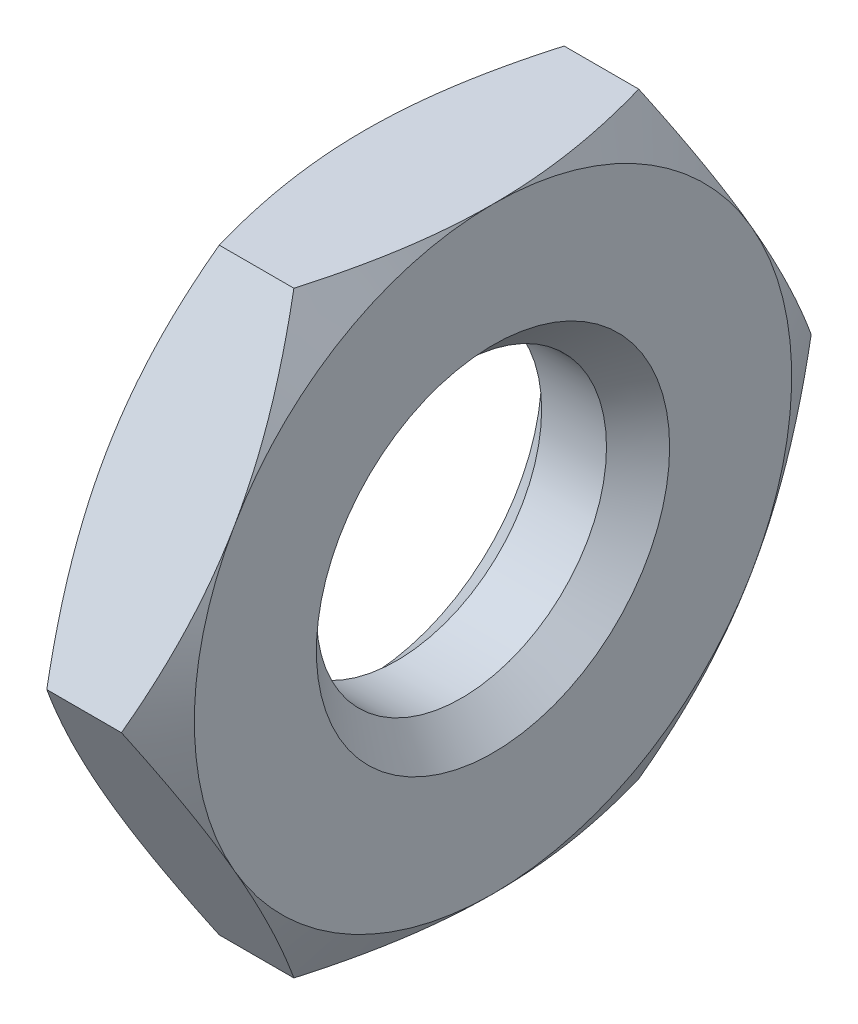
ISO-10303-21;
HEADER;
FILE_DESCRIPTION(('STEP AP214'),'2;1');
FILE_NAME('part.step','',(''),(''),'','','');
FILE_SCHEMA(('AUTOMOTIVE_DESIGN { 1 0 10303 214 1 1 1 1 }'));
ENDSEC;
DATA;
#1=APPLICATION_CONTEXT('core data for automotive mechanical design processes');
#2=APPLICATION_PROTOCOL_DEFINITION('international standard','automotive_design',2000,#1);
#3=PRODUCT_CONTEXT('',#1,'mechanical');
#4=PRODUCT('Part','Part','',(#3));
#5=PRODUCT_RELATED_PRODUCT_CATEGORY('part','',(#4));
#6=PRODUCT_DEFINITION_FORMATION('','',#4);
#7=PRODUCT_DEFINITION_CONTEXT('part definition',#1,'design');
#8=PRODUCT_DEFINITION('design','',#6,#7);
#9=PRODUCT_DEFINITION_SHAPE('','',#8);
#10=(LENGTH_UNIT() NAMED_UNIT(*) SI_UNIT(.MILLI.,.METRE.));
#11=(NAMED_UNIT(*) PLANE_ANGLE_UNIT() SI_UNIT($,.RADIAN.));
#12=(NAMED_UNIT(*) SI_UNIT($,.STERADIAN.) SOLID_ANGLE_UNIT());
#13=UNCERTAINTY_MEASURE_WITH_UNIT(LENGTH_MEASURE(1.E-05),#10,'distance_accuracy_value','');
#14=(GEOMETRIC_REPRESENTATION_CONTEXT(3) GLOBAL_UNCERTAINTY_ASSIGNED_CONTEXT((#13)) GLOBAL_UNIT_ASSIGNED_CONTEXT((#10,
#11,#12)) REPRESENTATION_CONTEXT('',''));
#15=CARTESIAN_POINT('',(0.,0.,0.));
#16=DIRECTION('',(0.,0.,1.));
#17=DIRECTION('',(1.,0.,0.));
#18=AXIS2_PLACEMENT_3D('',#15,#16,#17);
#19=CARTESIAN_POINT('',(0.75,1.75,-1.01036297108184));
#20=DIRECTION('',(1.,0.,0.));
#21=DIRECTION('',(0.,0.,-1.));
#22=AXIS2_PLACEMENT_3D('',#19,#20,#21);
#23=PLANE('',#22);
#24=CARTESIAN_POINT('',(0.75,0.,0.));
#25=DIRECTION('',(1.,0.,0.));
#26=DIRECTION('',(0.,0.,-1.));
#27=AXIS2_PLACEMENT_3D('',#24,#25,#26);
#28=CIRCLE('',#27,1.035);
#29=CARTESIAN_POINT('',(0.75,0.,-1.035));
#30=VERTEX_POINT('',#29);
#31=EDGE_CURVE('E11',#30,#30,#28,.F.);
#32=ORIENTED_EDGE('',*,*,#31,.T.);
#33=EDGE_LOOP('',(#32));
#34=FACE_BOUND('',#33,.T.);
#35=CARTESIAN_POINT('',(0.75,0.,0.));
#36=DIRECTION('',(1.,0.,0.));
#37=DIRECTION('',(0.,0.,-1.));
#38=AXIS2_PLACEMENT_3D('',#35,#36,#37);
#39=CIRCLE('',#38,1.75);
#40=CARTESIAN_POINT('',(0.75,-1.75,0.));
#41=VERTEX_POINT('',#40);
#42=CARTESIAN_POINT('',(0.75,-0.875000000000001,-1.51554445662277));
#43=VERTEX_POINT('',#42);
#44=EDGE_CURVE('E142',#41,#43,#39,.T.);
#45=ORIENTED_EDGE('',*,*,#44,.T.);
#46=CARTESIAN_POINT('',(0.75,0.875000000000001,-1.51554445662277));
#47=VERTEX_POINT('',#46);
#48=EDGE_CURVE('E130',#43,#47,#39,.T.);
#49=ORIENTED_EDGE('',*,*,#48,.T.);
#50=CARTESIAN_POINT('',(0.75,1.75,0.));
#51=VERTEX_POINT('',#50);
#52=EDGE_CURVE('E144',#47,#51,#39,.T.);
#53=ORIENTED_EDGE('',*,*,#52,.T.);
#54=CARTESIAN_POINT('',(0.75,0.875,1.51554445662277));
#55=VERTEX_POINT('',#54);
#56=EDGE_CURVE('E55',#51,#55,#39,.T.);
#57=ORIENTED_EDGE('',*,*,#56,.T.);
#58=CARTESIAN_POINT('',(0.75,-0.875,1.51554445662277));
#59=VERTEX_POINT('',#58);
#60=EDGE_CURVE('E63',#55,#59,#39,.T.);
#61=ORIENTED_EDGE('',*,*,#60,.T.);
#62=EDGE_CURVE('E166',#59,#41,#39,.T.);
#63=ORIENTED_EDGE('',*,*,#62,.T.);
#64=EDGE_LOOP('',(#45,#49,#53,#57,#61,#63));
#65=FACE_BOUND('',#64,.T.);
#66=ADVANCED_FACE('F39',(#34,#65),#23,.T.);
#67=CARTESIAN_POINT('',(0.,1.75,-1.01036297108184));
#68=DIRECTION('',(1.,0.,0.));
#69=DIRECTION('',(0.,0.,-1.));
#70=AXIS2_PLACEMENT_3D('',#67,#68,#69);
#71=PLANE('',#70);
#72=CARTESIAN_POINT('',(0.,0.,0.));
#73=DIRECTION('',(1.,0.,0.));
#74=DIRECTION('',(0.,0.,-1.));
#75=AXIS2_PLACEMENT_3D('',#72,#73,#74);
#76=CIRCLE('',#75,1.035);
#77=CARTESIAN_POINT('',(0.,0.,-1.035));
#78=VERTEX_POINT('',#77);
#79=EDGE_CURVE('E164',#78,#78,#76,.T.);
#80=ORIENTED_EDGE('',*,*,#79,.T.);
#81=EDGE_LOOP('',(#80));
#82=FACE_BOUND('',#81,.T.);
#83=CARTESIAN_POINT('',(0.,0.,0.));
#84=DIRECTION('',(1.,0.,0.));
#85=DIRECTION('',(0.,0.,-1.));
#86=AXIS2_PLACEMENT_3D('',#83,#84,#85);
#87=CIRCLE('',#86,1.75);
#88=CARTESIAN_POINT('',(0.,-0.875,-1.51554445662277));
#89=VERTEX_POINT('',#88);
#90=CARTESIAN_POINT('',(0.,0.875000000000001,-1.51554445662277));
#91=VERTEX_POINT('',#90);
#92=EDGE_CURVE('E173',#89,#91,#87,.T.);
#93=ORIENTED_EDGE('',*,*,#92,.F.);
#94=CARTESIAN_POINT('',(0.,-1.75,0.));
#95=VERTEX_POINT('',#94);
#96=EDGE_CURVE('E318',#95,#89,#87,.T.);
#97=ORIENTED_EDGE('',*,*,#96,.F.);
#98=CARTESIAN_POINT('',(0.,-0.875,1.51554445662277));
#99=VERTEX_POINT('',#98);
#100=EDGE_CURVE('E321',#99,#95,#87,.T.);
#101=ORIENTED_EDGE('',*,*,#100,.F.);
#102=CARTESIAN_POINT('',(0.,0.875,1.51554445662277));
#103=VERTEX_POINT('',#102);
#104=EDGE_CURVE('E327',#103,#99,#87,.T.);
#105=ORIENTED_EDGE('',*,*,#104,.F.);
#106=CARTESIAN_POINT('',(0.,1.75,0.));
#107=VERTEX_POINT('',#106);
#108=EDGE_CURVE('E178',#107,#103,#87,.T.);
#109=ORIENTED_EDGE('',*,*,#108,.F.);
#110=EDGE_CURVE('E174',#91,#107,#87,.T.);
#111=ORIENTED_EDGE('',*,*,#110,.F.);
#112=EDGE_LOOP('',(#93,#97,#101,#105,#109,#111));
#113=FACE_BOUND('',#112,.T.);
#114=ADVANCED_FACE('F319',(#82,#113),#71,.F.);
#115=CARTESIAN_POINT('',(0.75,0.,0.));
#116=DIRECTION('',(-1.,0.,0.));
#117=DIRECTION('',(0.,0.,1.));
#118=AXIS2_PLACEMENT_3D('',#115,#116,#117);
#119=CYLINDRICAL_SURFACE('',#118,0.85);
#120=CARTESIAN_POINT('',(0.185000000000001,0.,0.));
#121=DIRECTION('',(1.,0.,0.));
#122=DIRECTION('',(0.,0.,-1.));
#123=AXIS2_PLACEMENT_3D('',#120,#121,#122);
#124=CIRCLE('',#123,0.85);
#125=CARTESIAN_POINT('',(0.185000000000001,0.,-0.85));
#126=VERTEX_POINT('',#125);
#127=EDGE_CURVE('E48',#126,#126,#124,.F.);
#128=ORIENTED_EDGE('',*,*,#127,.T.);
#129=EDGE_LOOP('',(#128));
#130=FACE_BOUND('',#129,.T.);
#131=CARTESIAN_POINT('',(0.565000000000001,0.,0.));
#132=DIRECTION('',(1.,0.,0.));
#133=DIRECTION('',(0.,0.,-1.));
#134=AXIS2_PLACEMENT_3D('',#131,#132,#133);
#135=CIRCLE('',#134,0.85);
#136=CARTESIAN_POINT('',(0.565000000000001,0.,-0.85));
#137=VERTEX_POINT('',#136);
#138=EDGE_CURVE('E389',#137,#137,#135,.T.);
#139=ORIENTED_EDGE('',*,*,#138,.T.);
#140=EDGE_LOOP('',(#139));
#141=FACE_BOUND('',#140,.T.);
#142=ADVANCED_FACE('F234',(#130,#141),#119,.F.);
#143=CARTESIAN_POINT('',(0.,0.,0.));
#144=DIRECTION('',(1.,0.,0.));
#145=DIRECTION('',(0.,0.,-1.));
#146=AXIS2_PLACEMENT_3D('',#143,#144,#145);
#147=CONICAL_SURFACE('',#146,1.75,1.0471975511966);
#148=CARTESIAN_POINT('',(0.156370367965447,-1.7502,-1.01024750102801));
#149=CARTESIAN_POINT('',(0.130723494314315,-1.67329472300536,-1.05464878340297));
#150=CARTESIAN_POINT('',(0.107398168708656,-1.59572560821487,-1.09943333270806));
#151=CARTESIAN_POINT('',(0.0666825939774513,-1.43924404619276,-1.18977800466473));
#152=CARTESIAN_POINT('',(0.0493067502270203,-1.36032881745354,-1.23533973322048));
#153=CARTESIAN_POINT('',(0.0222573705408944,-1.20347641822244,-1.3258985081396));
#154=CARTESIAN_POINT('',(0.0124038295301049,-1.12556338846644,-1.3708816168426));
#155=CARTESIAN_POINT('',(0.000638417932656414,-0.96937051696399,-1.46105961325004));
#156=CARTESIAN_POINT('',(-0.00128319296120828,-0.891091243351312,-1.50625417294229));
#157=CARTESIAN_POINT('',(0.00270360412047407,-0.74480845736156,-1.59071057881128));
#158=CARTESIAN_POINT('',(0.00763311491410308,-0.676783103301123,-1.6299850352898));
#159=CARTESIAN_POINT('',(0.0232601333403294,-0.541175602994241,-1.70827806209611));
#160=CARTESIAN_POINT('',(0.0339629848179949,-0.4735939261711,-1.74729636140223));
#161=CARTESIAN_POINT('',(0.0607206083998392,-0.337706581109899,-1.82575095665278));
#162=CARTESIAN_POINT('',(0.0768888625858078,-0.269418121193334,-1.86517731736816));
#163=CARTESIAN_POINT('',(0.113584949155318,-0.133860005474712,-1.94344183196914));
#164=CARTESIAN_POINT('',(0.134104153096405,-0.0665886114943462,-1.98228098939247));
#165=CARTESIAN_POINT('',(0.156370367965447,0.000200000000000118,-2.02084141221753));
#166=B_SPLINE_CURVE_WITH_KNOTS('',3,(#148,#149,#150,#151,#152,#153,#154,#155,#156,#157,#158,
#159,#160,#161,#162,#163,#164,#165),.UNSPECIFIED.,.F.,.F.,(4,2,2,2,2,2,2,2,4),(0.,
0.277404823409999,0.55547664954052,0.826665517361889,1.09752126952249,1.33340700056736,
1.56951144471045,1.8108547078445,2.05172376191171),.UNSPECIFIED.);
#167=CARTESIAN_POINT('',(0.156303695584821,0.,-2.02072594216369));
#168=VERTEX_POINT('',#167);
#169=EDGE_CURVE('E334',#89,#168,#166,.T.);
#170=ORIENTED_EDGE('',*,*,#169,.F.);
#171=ORIENTED_EDGE('',*,*,#92,.T.);
#172=CARTESIAN_POINT('',(0.156370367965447,-0.00020000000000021,-2.02084141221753));
#173=CARTESIAN_POINT('',(0.130723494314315,0.0767052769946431,-1.97644012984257));
#174=CARTESIAN_POINT('',(0.107398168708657,0.154274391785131,-1.93165558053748));
#175=CARTESIAN_POINT('',(0.0666825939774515,0.310755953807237,-1.8413109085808));
#176=CARTESIAN_POINT('',(0.0493067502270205,0.389671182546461,-1.79574918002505));
#177=CARTESIAN_POINT('',(0.0222573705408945,0.546523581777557,-1.70519040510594));
#178=CARTESIAN_POINT('',(0.012403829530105,0.624436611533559,-1.66020729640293));
#179=CARTESIAN_POINT('',(0.000638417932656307,0.78062948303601,-1.57002929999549));
#180=CARTESIAN_POINT('',(-0.00128319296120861,0.858908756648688,-1.52483474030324));
#181=CARTESIAN_POINT('',(0.00270360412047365,1.00519154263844,-1.44037833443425));
#182=CARTESIAN_POINT('',(0.00763311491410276,1.07321689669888,-1.40110387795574));
#183=CARTESIAN_POINT('',(0.0232601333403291,1.20882439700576,-1.32281085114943));
#184=CARTESIAN_POINT('',(0.0339629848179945,1.2764060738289,-1.2837925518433));
#185=CARTESIAN_POINT('',(0.0607206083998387,1.4122934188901,-1.20533795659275));
#186=CARTESIAN_POINT('',(0.0768888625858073,1.48058187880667,-1.16591159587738));
#187=CARTESIAN_POINT('',(0.113584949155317,1.61613999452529,-1.08764708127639));
#188=CARTESIAN_POINT('',(0.134104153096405,1.68341138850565,-1.04880792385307));
#189=CARTESIAN_POINT('',(0.156370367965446,1.7502,-1.01024750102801));
#190=B_SPLINE_CURVE_WITH_KNOTS('',3,(#172,#173,#174,#175,#176,#177,#178,#179,#180,#181,#182,
#183,#184,#185,#186,#187,#188,#189),.UNSPECIFIED.,.F.,.F.,(4,2,2,2,2,2,2,2,4),(0.,
0.277404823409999,0.55547664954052,0.826665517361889,1.09752126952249,1.33340700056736,
1.56951144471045,1.8108547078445,2.05172376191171),.UNSPECIFIED.);
#191=EDGE_CURVE('E215',#168,#91,#190,.T.);
#192=ORIENTED_EDGE('',*,*,#191,.F.);
#193=EDGE_LOOP('',(#170,#171,#192));
#194=FACE_BOUND('',#193,.T.);
#195=ADVANCED_FACE('F194',(#194),#147,.T.);
#196=ORIENTED_EDGE('',*,*,#96,.T.);
#197=CARTESIAN_POINT('',(0.156303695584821,-1.75,-1.01036297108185));
#198=VERTEX_POINT('',#197);
#199=EDGE_CURVE('E156',#198,#89,#166,.T.);
#200=ORIENTED_EDGE('',*,*,#199,.F.);
#201=CARTESIAN_POINT('',(0.852167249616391,-1.75,-2.71008421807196));
#202=CARTESIAN_POINT('',(0.815121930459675,-1.75,-2.63368408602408));
#203=CARTESIAN_POINT('',(0.778432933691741,-1.75,-2.55710815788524));
#204=CARTESIAN_POINT('',(0.705968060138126,-1.75,-2.40351121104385));
#205=CARTESIAN_POINT('',(0.670192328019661,-1.75,-2.3264901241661));
#206=CARTESIAN_POINT('',(0.599573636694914,-1.75,-2.17151065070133));
#207=CARTESIAN_POINT('',(0.564736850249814,-1.75,-2.09354944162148));
#208=CARTESIAN_POINT('',(0.496494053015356,-1.75,-1.93700560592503));
#209=CARTESIAN_POINT('',(0.463087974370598,-1.75,-1.85842300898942));
#210=CARTESIAN_POINT('',(0.397041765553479,-1.75,-1.6979784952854));
#211=CARTESIAN_POINT('',(0.364460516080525,-1.75,-1.61609220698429));
#212=CARTESIAN_POINT('',(0.301780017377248,-1.75,-1.45137686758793));
#213=CARTESIAN_POINT('',(0.271680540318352,-1.75,-1.36854790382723));
#214=CARTESIAN_POINT('',(0.214746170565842,-1.75,-1.20194685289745));
#215=CARTESIAN_POINT('',(0.187904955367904,-1.75,-1.11817694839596));
#216=CARTESIAN_POINT('',(0.138354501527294,-1.75,-0.949435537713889));
#217=CARTESIAN_POINT('',(0.115643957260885,-1.75,-0.864464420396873));
#218=CARTESIAN_POINT('',(0.075568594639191,-1.75,-0.69374480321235));
#219=CARTESIAN_POINT('',(0.0581748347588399,-1.75,-0.608003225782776));
#220=CARTESIAN_POINT('',(0.0297174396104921,-1.75,-0.435458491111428));
#221=CARTESIAN_POINT('',(0.0186532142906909,-1.75,-0.348655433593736));
#222=CARTESIAN_POINT('',(0.00388537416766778,-1.75,-0.175550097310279));
#223=CARTESIAN_POINT('',(8.74575374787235E-05,-1.75,-0.0892560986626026));
#224=CARTESIAN_POINT('',(-8.45672730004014E-05,-1.75,0.0833363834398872));
#225=CARTESIAN_POINT('',(0.00354146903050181,-1.75,0.169634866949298));
#226=CARTESIAN_POINT('',(0.0208500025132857,-1.75,0.376909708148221));
#227=CARTESIAN_POINT('',(0.0380466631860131,-1.75,0.49759441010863));
#228=CARTESIAN_POINT('',(0.0839386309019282,-1.75,0.736761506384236));
#229=CARTESIAN_POINT('',(0.112645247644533,-1.75,0.855241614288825));
#230=CARTESIAN_POINT('',(0.179145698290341,-1.75,1.09237455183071));
#231=CARTESIAN_POINT('',(0.217125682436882,-1.75,1.21097375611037));
#232=CARTESIAN_POINT('',(0.299164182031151,-1.75,1.44596952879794));
#233=CARTESIAN_POINT('',(0.343221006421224,-1.75,1.56236669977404));
#234=CARTESIAN_POINT('',(0.450980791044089,-1.75,1.83207817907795));
#235=CARTESIAN_POINT('',(0.516328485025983,-1.75,1.98472852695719));
#236=CARTESIAN_POINT('',(0.651758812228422,-1.75,2.28792751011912));
#237=CARTESIAN_POINT('',(0.721842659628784,-1.75,2.43847559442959));
#238=CARTESIAN_POINT('',(0.865206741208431,-1.75,2.73821531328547));
#239=CARTESIAN_POINT('',(0.938490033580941,-1.75,2.88740547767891));
#240=CARTESIAN_POINT('',(1.08720647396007,-1.75,3.18471144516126));
#241=CARTESIAN_POINT('',(1.16263969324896,-1.75,3.3328272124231));
#242=CARTESIAN_POINT('',(1.30880326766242,-1.75,3.61618537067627));
#243=CARTESIAN_POINT('',(1.37941363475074,-1.75,3.75148981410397));
#244=CARTESIAN_POINT('',(1.52160774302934,-1.75,4.02159130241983));
#245=CARTESIAN_POINT('',(1.59319151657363,-1.75,4.15638833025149));
#246=CARTESIAN_POINT('',(1.73693002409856,-1.75,4.4252610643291));
#247=CARTESIAN_POINT('',(1.80908297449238,-1.75,4.55933772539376));
#248=CARTESIAN_POINT('',(1.9539741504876,-1.75,4.82716533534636));
#249=CARTESIAN_POINT('',(2.02671234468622,-1.75,4.96091630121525));
#250=CARTESIAN_POINT('',(2.09966957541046,-1.75,5.09454682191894));
#251=B_SPLINE_CURVE_WITH_KNOTS('',3,(#201,#202,#203,#204,#205,#206,#207,#208,#209,#210,#211,
#212,#213,#214,#215,#216,#217,#218,#219,#220,#221,#222,#223,#224,#225,#226,#227,#228,#229,#230,
#231,#232,#233,#234,#235,#236,#237,#238,#239,#240,#241,#242,#243,#244,#245,#246,#247,#248,#249,
#250),.UNSPECIFIED.,.F.,.F.,(4,2,2,2,2,2,2,2,2,2,2,2,2,2,2,2,2,2,2,2,2,2,2,2,4),(0.,
0.254726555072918,0.509493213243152,0.765653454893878,1.02180153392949,1.28616067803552,
1.55049552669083,1.81430895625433,2.07803885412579,2.34030648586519,2.60254966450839,
2.86136574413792,3.12018686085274,3.48514477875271,3.85046218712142,4.22382243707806,
4.59707899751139,5.09508985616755,5.59322887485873,6.0918549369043,6.59049755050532,
7.04835507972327,7.50622786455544,7.96300127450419,8.41975033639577),.UNSPECIFIED.);
#252=EDGE_CURVE('E177',#95,#198,#251,.F.);
#253=ORIENTED_EDGE('',*,*,#252,.F.);
#254=EDGE_LOOP('',(#196,#200,#253));
#255=FACE_BOUND('',#254,.T.);
#256=ADVANCED_FACE('F353',(#255),#147,.T.);
#257=CARTESIAN_POINT('',(0.375,0.,0.));
#258=DIRECTION('',(-1.,0.,0.));
#259=DIRECTION('',(0.,0.,1.));
#260=AXIS2_PLACEMENT_3D('',#257,#258,#259);
#261=CONICAL_SURFACE('',#260,2.39951905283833,1.0471975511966);
#262=CARTESIAN_POINT('',(0.593629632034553,0.000199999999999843,-2.02084141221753));
#263=CARTESIAN_POINT('',(0.619276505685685,-0.0767052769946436,-1.97644012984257));
#264=CARTESIAN_POINT('',(0.642601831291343,-0.154274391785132,-1.93165558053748));
#265=CARTESIAN_POINT('',(0.683317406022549,-0.310755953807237,-1.8413109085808));
#266=CARTESIAN_POINT('',(0.70069324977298,-0.389671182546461,-1.79574918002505));
#267=CARTESIAN_POINT('',(0.727742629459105,-0.546523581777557,-1.70519040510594));
#268=CARTESIAN_POINT('',(0.737596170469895,-0.624436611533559,-1.66020729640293));
#269=CARTESIAN_POINT('',(0.749361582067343,-0.780629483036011,-1.57002929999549));
#270=CARTESIAN_POINT('',(0.751283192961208,-0.858908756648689,-1.52483474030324));
#271=CARTESIAN_POINT('',(0.747296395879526,-1.00519154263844,-1.44037833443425));
#272=CARTESIAN_POINT('',(0.742366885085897,-1.07321689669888,-1.40110387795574));
#273=CARTESIAN_POINT('',(0.72673986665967,-1.20882439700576,-1.32281085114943));
#274=CARTESIAN_POINT('',(0.716037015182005,-1.2764060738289,-1.2837925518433));
#275=CARTESIAN_POINT('',(0.689279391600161,-1.4122934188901,-1.20533795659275));
#276=CARTESIAN_POINT('',(0.673111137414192,-1.48058187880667,-1.16591159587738));
#277=CARTESIAN_POINT('',(0.636415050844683,-1.61613999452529,-1.08764708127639));
#278=CARTESIAN_POINT('',(0.615895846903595,-1.68341138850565,-1.04880792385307));
#279=CARTESIAN_POINT('',(0.593629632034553,-1.7502,-1.01024750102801));
#280=B_SPLINE_CURVE_WITH_KNOTS('',3,(#262,#263,#264,#265,#266,#267,#268,#269,#270,#271,#272,
#273,#274,#275,#276,#277,#278,#279),.UNSPECIFIED.,.F.,.F.,(4,2,2,2,2,2,2,2,4),(0.,
0.277404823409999,0.55547664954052,0.82666551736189,1.09752126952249,1.33340700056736,
1.56951144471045,1.8108547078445,2.05172376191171),.UNSPECIFIED.);
#281=CARTESIAN_POINT('',(0.593696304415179,-1.75,-1.01036297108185));
#282=VERTEX_POINT('',#281);
#283=EDGE_CURVE('E147',#43,#282,#280,.T.);
#284=ORIENTED_EDGE('',*,*,#283,.F.);
#285=ORIENTED_EDGE('',*,*,#44,.F.);
#286=CARTESIAN_POINT('',(-0.102167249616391,-1.75,-2.71008421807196));
#287=CARTESIAN_POINT('',(-0.0651219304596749,-1.75,-2.63368408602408));
#288=CARTESIAN_POINT('',(-0.0284329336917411,-1.75,-2.55710815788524));
#289=CARTESIAN_POINT('',(0.0440319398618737,-1.75,-2.40351121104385));
#290=CARTESIAN_POINT('',(0.0798076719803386,-1.75,-2.3264901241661));
#291=CARTESIAN_POINT('',(0.150426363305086,-1.75,-2.17151065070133));
#292=CARTESIAN_POINT('',(0.185263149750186,-1.75,-2.09354944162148));
#293=CARTESIAN_POINT('',(0.253505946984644,-1.75,-1.93700560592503));
#294=CARTESIAN_POINT('',(0.286912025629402,-1.75,-1.85842300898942));
#295=CARTESIAN_POINT('',(0.352958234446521,-1.75,-1.6979784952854));
#296=CARTESIAN_POINT('',(0.385539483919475,-1.75,-1.61609220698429));
#297=CARTESIAN_POINT('',(0.448219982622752,-1.75,-1.45137686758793));
#298=CARTESIAN_POINT('',(0.478319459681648,-1.75,-1.36854790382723));
#299=CARTESIAN_POINT('',(0.535253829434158,-1.75,-1.20194685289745));
#300=CARTESIAN_POINT('',(0.562095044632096,-1.75,-1.11817694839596));
#301=CARTESIAN_POINT('',(0.611645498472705,-1.75,-0.949435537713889));
#302=CARTESIAN_POINT('',(0.634356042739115,-1.75,-0.864464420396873));
#303=CARTESIAN_POINT('',(0.674431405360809,-1.75,-0.69374480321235));
#304=CARTESIAN_POINT('',(0.69182516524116,-1.75,-0.608003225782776));
#305=CARTESIAN_POINT('',(0.720282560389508,-1.75,-0.435458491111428));
#306=CARTESIAN_POINT('',(0.731346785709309,-1.75,-0.348655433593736));
#307=CARTESIAN_POINT('',(0.746114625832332,-1.75,-0.175550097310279));
#308=CARTESIAN_POINT('',(0.749912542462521,-1.75,-0.0892560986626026));
#309=CARTESIAN_POINT('',(0.750084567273,-1.75,0.0833363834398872));
#310=CARTESIAN_POINT('',(0.746458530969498,-1.75,0.169634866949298));
#311=CARTESIAN_POINT('',(0.729149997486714,-1.75,0.376909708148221));
#312=CARTESIAN_POINT('',(0.711953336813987,-1.75,0.49759441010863));
#313=CARTESIAN_POINT('',(0.666061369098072,-1.75,0.736761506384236));
#314=CARTESIAN_POINT('',(0.637354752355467,-1.75,0.855241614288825));
#315=CARTESIAN_POINT('',(0.570854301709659,-1.75,1.09237455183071));
#316=CARTESIAN_POINT('',(0.532874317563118,-1.75,1.21097375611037));
#317=CARTESIAN_POINT('',(0.450835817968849,-1.75,1.44596952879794));
#318=CARTESIAN_POINT('',(0.406778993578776,-1.75,1.56236669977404));
#319=CARTESIAN_POINT('',(0.299019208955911,-1.75,1.83207817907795));
#320=CARTESIAN_POINT('',(0.233671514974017,-1.75,1.98472852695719));
#321=CARTESIAN_POINT('',(0.0982411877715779,-1.75,2.28792751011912));
#322=CARTESIAN_POINT('',(0.0281573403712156,-1.75,2.43847559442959));
#323=CARTESIAN_POINT('',(-0.115206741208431,-1.75,2.73821531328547));
#324=CARTESIAN_POINT('',(-0.188490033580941,-1.75,2.88740547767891));
#325=CARTESIAN_POINT('',(-0.337206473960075,-1.75,3.18471144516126));
#326=CARTESIAN_POINT('',(-0.412639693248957,-1.75,3.3328272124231));
#327=CARTESIAN_POINT('',(-0.558803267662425,-1.75,3.61618537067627));
#328=CARTESIAN_POINT('',(-0.629413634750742,-1.75,3.75148981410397));
#329=CARTESIAN_POINT('',(-0.77160774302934,-1.75,4.02159130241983));
#330=CARTESIAN_POINT('',(-0.843191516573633,-1.75,4.15638833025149));
#331=CARTESIAN_POINT('',(-0.986930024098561,-1.75,4.4252610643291));
#332=CARTESIAN_POINT('',(-1.05908297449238,-1.75,4.55933772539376));
#333=CARTESIAN_POINT('',(-1.2039741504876,-1.75,4.82716533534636));
#334=CARTESIAN_POINT('',(-1.27671234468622,-1.75,4.96091630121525));
#335=CARTESIAN_POINT('',(-1.34966957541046,-1.75,5.09454682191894));
#336=B_SPLINE_CURVE_WITH_KNOTS('',3,(#286,#287,#288,#289,#290,#291,#292,#293,#294,#295,#296,
#297,#298,#299,#300,#301,#302,#303,#304,#305,#306,#307,#308,#309,#310,#311,#312,#313,#314,#315,
#316,#317,#318,#319,#320,#321,#322,#323,#324,#325,#326,#327,#328,#329,#330,#331,#332,#333,#334,
#335),.UNSPECIFIED.,.F.,.F.,(4,2,2,2,2,2,2,2,2,2,2,2,2,2,2,2,2,2,2,2,2,2,2,2,4),(0.,
0.254726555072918,0.509493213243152,0.765653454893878,1.02180153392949,1.28616067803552,
1.55049552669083,1.81430895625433,2.07803885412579,2.34030648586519,2.60254966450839,
2.86136574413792,3.12018686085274,3.48514477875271,3.85046218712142,4.22382243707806,
4.59707899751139,5.09508985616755,5.59322887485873,6.0918549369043,6.59049755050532,
7.04835507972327,7.50622786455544,7.96300127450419,8.41975033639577),.UNSPECIFIED.);
#337=EDGE_CURVE('E151',#282,#41,#336,.T.);
#338=ORIENTED_EDGE('',*,*,#337,.F.);
#339=EDGE_LOOP('',(#284,#285,#338));
#340=FACE_BOUND('',#339,.T.);
#341=ADVANCED_FACE('F148',(#340),#261,.T.);
#342=ORIENTED_EDGE('',*,*,#48,.F.);
#343=CARTESIAN_POINT('',(0.593696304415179,0.,-2.02072594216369));
#344=VERTEX_POINT('',#343);
#345=EDGE_CURVE('E134',#344,#43,#280,.T.);
#346=ORIENTED_EDGE('',*,*,#345,.F.);
#347=CARTESIAN_POINT('',(0.593629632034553,1.7502,-1.01024750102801));
#348=CARTESIAN_POINT('',(0.619276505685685,1.67329472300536,-1.05464878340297));
#349=CARTESIAN_POINT('',(0.642601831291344,1.59572560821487,-1.09943333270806));
#350=CARTESIAN_POINT('',(0.683317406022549,1.43924404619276,-1.18977800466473));
#351=CARTESIAN_POINT('',(0.70069324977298,1.36032881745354,-1.23533973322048));
#352=CARTESIAN_POINT('',(0.727742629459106,1.20347641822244,-1.3258985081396));
#353=CARTESIAN_POINT('',(0.737596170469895,1.12556338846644,-1.3708816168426));
#354=CARTESIAN_POINT('',(0.749361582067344,0.96937051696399,-1.46105961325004));
#355=CARTESIAN_POINT('',(0.751283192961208,0.891091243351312,-1.50625417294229));
#356=CARTESIAN_POINT('',(0.747296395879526,0.74480845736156,-1.59071057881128));
#357=CARTESIAN_POINT('',(0.742366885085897,0.676783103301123,-1.6299850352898));
#358=CARTESIAN_POINT('',(0.72673986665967,0.541175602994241,-1.70827806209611));
#359=CARTESIAN_POINT('',(0.716037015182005,0.4735939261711,-1.74729636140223));
#360=CARTESIAN_POINT('',(0.689279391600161,0.337706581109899,-1.82575095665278));
#361=CARTESIAN_POINT('',(0.673111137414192,0.269418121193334,-1.86517731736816));
#362=CARTESIAN_POINT('',(0.636415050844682,0.133860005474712,-1.94344183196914));
#363=CARTESIAN_POINT('',(0.615895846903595,0.0665886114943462,-1.98228098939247));
#364=CARTESIAN_POINT('',(0.593629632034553,-0.000200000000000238,-2.02084141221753));
#365=B_SPLINE_CURVE_WITH_KNOTS('',3,(#347,#348,#349,#350,#351,#352,#353,#354,#355,#356,#357,
#358,#359,#360,#361,#362,#363,#364),.UNSPECIFIED.,.F.,.F.,(4,2,2,2,2,2,2,2,4),(0.,
0.277404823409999,0.55547664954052,0.826665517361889,1.09752126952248,1.33340700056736,
1.56951144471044,1.8108547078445,2.05172376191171),.UNSPECIFIED.);
#366=EDGE_CURVE('E136',#47,#344,#365,.T.);
#367=ORIENTED_EDGE('',*,*,#366,.F.);
#368=EDGE_LOOP('',(#342,#346,#367));
#369=FACE_BOUND('',#368,.T.);
#370=ADVANCED_FACE('F132',(#369),#261,.T.);
#371=ORIENTED_EDGE('',*,*,#100,.T.);
#372=CARTESIAN_POINT('',(0.156303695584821,-1.75,1.01036297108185));
#373=VERTEX_POINT('',#372);
#374=EDGE_CURVE('E187',#373,#95,#251,.F.);
#375=ORIENTED_EDGE('',*,*,#374,.F.);
#376=CARTESIAN_POINT('',(0.156370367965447,0.000200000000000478,2.02084141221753));
#377=CARTESIAN_POINT('',(0.130723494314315,-0.0767052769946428,1.97644012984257));
#378=CARTESIAN_POINT('',(0.107398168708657,-0.154274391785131,1.93165558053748));
#379=CARTESIAN_POINT('',(0.0666825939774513,-0.310755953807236,1.8413109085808));
#380=CARTESIAN_POINT('',(0.0493067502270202,-0.389671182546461,1.79574918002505));
#381=CARTESIAN_POINT('',(0.0222573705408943,-0.546523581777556,1.70519040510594));
#382=CARTESIAN_POINT('',(0.0124038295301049,-0.624436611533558,1.66020729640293));
#383=CARTESIAN_POINT('',(0.000638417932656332,-0.78062948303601,1.57002929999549));
#384=CARTESIAN_POINT('',(-0.00128319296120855,-0.858908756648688,1.52483474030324));
#385=CARTESIAN_POINT('',(0.00270360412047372,-1.00519154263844,1.44037833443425));
#386=CARTESIAN_POINT('',(0.00763311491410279,-1.07321689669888,1.40110387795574));
#387=CARTESIAN_POINT('',(0.0232601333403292,-1.20882439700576,1.32281085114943));
#388=CARTESIAN_POINT('',(0.0339629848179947,-1.2764060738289,1.2837925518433));
#389=CARTESIAN_POINT('',(0.060720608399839,-1.4122934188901,1.20533795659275));
#390=CARTESIAN_POINT('',(0.0768888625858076,-1.48058187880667,1.16591159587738));
#391=CARTESIAN_POINT('',(0.113584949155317,-1.61613999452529,1.08764708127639));
#392=CARTESIAN_POINT('',(0.134104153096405,-1.68341138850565,1.04880792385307));
#393=CARTESIAN_POINT('',(0.156370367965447,-1.7502,1.01024750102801));
#394=B_SPLINE_CURVE_WITH_KNOTS('',3,(#376,#377,#378,#379,#380,#381,#382,#383,#384,#385,#386,
#387,#388,#389,#390,#391,#392,#393),.UNSPECIFIED.,.F.,.F.,(4,2,2,2,2,2,2,2,4),(0.,
0.277404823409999,0.55547664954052,0.826665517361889,1.09752126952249,1.33340700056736,
1.56951144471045,1.8108547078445,2.05172376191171),.UNSPECIFIED.);
#395=EDGE_CURVE('E188',#99,#373,#394,.T.);
#396=ORIENTED_EDGE('',*,*,#395,.F.);
#397=EDGE_LOOP('',(#371,#375,#396));
#398=FACE_BOUND('',#397,.T.);
#399=ADVANCED_FACE('F352',(#398),#147,.T.);
#400=CARTESIAN_POINT('',(0.593696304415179,-1.75,1.01036297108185));
#401=VERTEX_POINT('',#400);
#402=EDGE_CURVE('E216',#41,#401,#336,.T.);
#403=ORIENTED_EDGE('',*,*,#402,.F.);
#404=ORIENTED_EDGE('',*,*,#62,.F.);
#405=CARTESIAN_POINT('',(0.593629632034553,-1.7502,1.01024750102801));
#406=CARTESIAN_POINT('',(0.619276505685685,-1.67329472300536,1.05464878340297));
#407=CARTESIAN_POINT('',(0.642601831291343,-1.59572560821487,1.09943333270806));
#408=CARTESIAN_POINT('',(0.683317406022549,-1.43924404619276,1.18977800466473));
#409=CARTESIAN_POINT('',(0.70069324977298,-1.36032881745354,1.23533973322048));
#410=CARTESIAN_POINT('',(0.727742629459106,-1.20347641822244,1.3258985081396));
#411=CARTESIAN_POINT('',(0.737596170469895,-1.12556338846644,1.3708816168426));
#412=CARTESIAN_POINT('',(0.749361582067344,-0.96937051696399,1.46105961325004));
#413=CARTESIAN_POINT('',(0.751283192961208,-0.891091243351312,1.50625417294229));
#414=CARTESIAN_POINT('',(0.747296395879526,-0.74480845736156,1.59071057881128));
#415=CARTESIAN_POINT('',(0.742366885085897,-0.676783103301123,1.6299850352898));
#416=CARTESIAN_POINT('',(0.726739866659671,-0.541175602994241,1.70827806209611));
#417=CARTESIAN_POINT('',(0.716037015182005,-0.4735939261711,1.74729636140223));
#418=CARTESIAN_POINT('',(0.689279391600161,-0.337706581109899,1.82575095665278));
#419=CARTESIAN_POINT('',(0.673111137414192,-0.269418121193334,1.86517731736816));
#420=CARTESIAN_POINT('',(0.636415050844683,-0.133860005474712,1.94344183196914));
#421=CARTESIAN_POINT('',(0.615895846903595,-0.0665886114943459,1.98228098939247));
#422=CARTESIAN_POINT('',(0.593629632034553,0.000200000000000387,2.02084141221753));
#423=B_SPLINE_CURVE_WITH_KNOTS('',3,(#405,#406,#407,#408,#409,#410,#411,#412,#413,#414,#415,
#416,#417,#418,#419,#420,#421,#422),.UNSPECIFIED.,.F.,.F.,(4,2,2,2,2,2,2,2,4),(0.,
0.277404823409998,0.55547664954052,0.826665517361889,1.09752126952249,1.33340700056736,
1.56951144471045,1.8108547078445,2.05172376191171),.UNSPECIFIED.);
#424=EDGE_CURVE('E247',#401,#59,#423,.T.);
#425=ORIENTED_EDGE('',*,*,#424,.F.);
#426=EDGE_LOOP('',(#403,#404,#425));
#427=FACE_BOUND('',#426,.T.);
#428=ADVANCED_FACE('F430',(#427),#261,.T.);
#429=ORIENTED_EDGE('',*,*,#104,.T.);
#430=CARTESIAN_POINT('',(0.156303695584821,0.,2.02072594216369));
#431=VERTEX_POINT('',#430);
#432=EDGE_CURVE('E288',#431,#99,#394,.T.);
#433=ORIENTED_EDGE('',*,*,#432,.F.);
#434=CARTESIAN_POINT('',(0.156370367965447,1.7502,1.01024750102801));
#435=CARTESIAN_POINT('',(0.130723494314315,1.67329472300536,1.05464878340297));
#436=CARTESIAN_POINT('',(0.107398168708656,1.59572560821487,1.09943333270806));
#437=CARTESIAN_POINT('',(0.0666825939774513,1.43924404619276,1.18977800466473));
#438=CARTESIAN_POINT('',(0.0493067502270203,1.36032881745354,1.23533973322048));
#439=CARTESIAN_POINT('',(0.0222573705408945,1.20347641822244,1.3258985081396));
#440=CARTESIAN_POINT('',(0.0124038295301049,1.12556338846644,1.3708816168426));
#441=CARTESIAN_POINT('',(0.000638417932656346,0.969370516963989,1.46105961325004));
#442=CARTESIAN_POINT('',(-0.00128319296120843,0.891091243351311,1.50625417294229));
#443=CARTESIAN_POINT('',(0.00270360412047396,0.744808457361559,1.59071057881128));
#444=CARTESIAN_POINT('',(0.00763311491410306,0.676783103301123,1.6299850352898));
#445=CARTESIAN_POINT('',(0.0232601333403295,0.541175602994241,1.70827806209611));
#446=CARTESIAN_POINT('',(0.0339629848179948,0.4735939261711,1.74729636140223));
#447=CARTESIAN_POINT('',(0.0607206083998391,0.3377065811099,1.82575095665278));
#448=CARTESIAN_POINT('',(0.0768888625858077,0.269418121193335,1.86517731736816));
#449=CARTESIAN_POINT('',(0.113584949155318,0.133860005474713,1.94344183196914));
#450=CARTESIAN_POINT('',(0.134104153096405,0.0665886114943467,1.98228098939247));
#451=CARTESIAN_POINT('',(0.156370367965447,-0.000199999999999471,2.02084141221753));
#452=B_SPLINE_CURVE_WITH_KNOTS('',3,(#434,#435,#436,#437,#438,#439,#440,#441,#442,#443,#444,
#445,#446,#447,#448,#449,#450,#451),.UNSPECIFIED.,.F.,.F.,(4,2,2,2,2,2,2,2,4),(0.,
0.277404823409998,0.55547664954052,0.82666551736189,1.09752126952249,1.33340700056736,
1.56951144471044,1.8108547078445,2.05172376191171),.UNSPECIFIED.);
#453=EDGE_CURVE('E282',#103,#431,#452,.T.);
#454=ORIENTED_EDGE('',*,*,#453,.F.);
#455=EDGE_LOOP('',(#429,#433,#454));
#456=FACE_BOUND('',#455,.T.);
#457=ADVANCED_FACE('F232',(#456),#147,.T.);
#458=CARTESIAN_POINT('',(0.593696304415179,0.,2.02072594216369));
#459=VERTEX_POINT('',#458);
#460=EDGE_CURVE('E377',#59,#459,#423,.T.);
#461=ORIENTED_EDGE('',*,*,#460,.F.);
#462=ORIENTED_EDGE('',*,*,#60,.F.);
#463=CARTESIAN_POINT('',(0.593629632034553,-0.000199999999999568,2.02084141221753));
#464=CARTESIAN_POINT('',(0.619276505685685,0.0767052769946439,1.97644012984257));
#465=CARTESIAN_POINT('',(0.642601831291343,0.154274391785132,1.93165558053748));
#466=CARTESIAN_POINT('',(0.683317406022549,0.310755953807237,1.8413109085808));
#467=CARTESIAN_POINT('',(0.70069324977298,0.389671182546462,1.79574918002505));
#468=CARTESIAN_POINT('',(0.727742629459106,0.546523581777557,1.70519040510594));
#469=CARTESIAN_POINT('',(0.737596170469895,0.624436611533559,1.66020729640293));
#470=CARTESIAN_POINT('',(0.749361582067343,0.780629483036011,1.57002929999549));
#471=CARTESIAN_POINT('',(0.751283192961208,0.858908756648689,1.52483474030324));
#472=CARTESIAN_POINT('',(0.747296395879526,1.00519154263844,1.44037833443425));
#473=CARTESIAN_POINT('',(0.742366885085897,1.07321689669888,1.40110387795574));
#474=CARTESIAN_POINT('',(0.72673986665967,1.20882439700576,1.32281085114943));
#475=CARTESIAN_POINT('',(0.716037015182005,1.2764060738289,1.2837925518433));
#476=CARTESIAN_POINT('',(0.689279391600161,1.4122934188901,1.20533795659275));
#477=CARTESIAN_POINT('',(0.673111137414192,1.48058187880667,1.16591159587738));
#478=CARTESIAN_POINT('',(0.636415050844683,1.61613999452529,1.0876470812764));
#479=CARTESIAN_POINT('',(0.615895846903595,1.68341138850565,1.04880792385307));
#480=CARTESIAN_POINT('',(0.593629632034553,1.7502,1.01024750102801));
#481=B_SPLINE_CURVE_WITH_KNOTS('',3,(#463,#464,#465,#466,#467,#468,#469,#470,#471,#472,#473,
#474,#475,#476,#477,#478,#479,#480),.UNSPECIFIED.,.F.,.F.,(4,2,2,2,2,2,2,2,4),(0.,
0.277404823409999,0.55547664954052,0.826665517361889,1.09752126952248,1.33340700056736,
1.56951144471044,1.8108547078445,2.05172376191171),.UNSPECIFIED.);
#482=EDGE_CURVE('E371',#459,#55,#481,.T.);
#483=ORIENTED_EDGE('',*,*,#482,.F.);
#484=EDGE_LOOP('',(#461,#462,#483));
#485=FACE_BOUND('',#484,.T.);
#486=ADVANCED_FACE('F227',(#485),#261,.T.);
#487=ORIENTED_EDGE('',*,*,#108,.T.);
#488=CARTESIAN_POINT('',(0.156303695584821,1.75,1.01036297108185));
#489=VERTEX_POINT('',#488);
#490=EDGE_CURVE('E281',#489,#103,#452,.T.);
#491=ORIENTED_EDGE('',*,*,#490,.F.);
#492=CARTESIAN_POINT('',(0.852167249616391,1.75,-2.71008421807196));
#493=CARTESIAN_POINT('',(0.815121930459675,1.75,-2.63368408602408));
#494=CARTESIAN_POINT('',(0.778432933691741,1.75,-2.55710815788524));
#495=CARTESIAN_POINT('',(0.705968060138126,1.75,-2.40351121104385));
#496=CARTESIAN_POINT('',(0.670192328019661,1.75,-2.3264901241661));
#497=CARTESIAN_POINT('',(0.599573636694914,1.75,-2.17151065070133));
#498=CARTESIAN_POINT('',(0.564736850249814,1.75,-2.09354944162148));
#499=CARTESIAN_POINT('',(0.496494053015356,1.75,-1.93700560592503));
#500=CARTESIAN_POINT('',(0.463087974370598,1.75,-1.85842300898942));
#501=CARTESIAN_POINT('',(0.397041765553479,1.75,-1.6979784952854));
#502=CARTESIAN_POINT('',(0.364460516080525,1.75,-1.61609220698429));
#503=CARTESIAN_POINT('',(0.301780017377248,1.75,-1.45137686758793));
#504=CARTESIAN_POINT('',(0.271680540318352,1.75,-1.36854790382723));
#505=CARTESIAN_POINT('',(0.214746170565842,1.75,-1.20194685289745));
#506=CARTESIAN_POINT('',(0.187904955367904,1.75,-1.11817694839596));
#507=CARTESIAN_POINT('',(0.138354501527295,1.75,-0.94943553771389));
#508=CARTESIAN_POINT('',(0.115643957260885,1.75,-0.864464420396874));
#509=CARTESIAN_POINT('',(0.0755685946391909,1.75,-0.69374480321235));
#510=CARTESIAN_POINT('',(0.0581748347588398,1.75,-0.608003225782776));
#511=CARTESIAN_POINT('',(0.0297174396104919,1.75,-0.435458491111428));
#512=CARTESIAN_POINT('',(0.0186532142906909,1.75,-0.348655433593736));
#513=CARTESIAN_POINT('',(0.00388537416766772,1.75,-0.175550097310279));
#514=CARTESIAN_POINT('',(8.74575374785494E-05,1.75,-0.0892560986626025));
#515=CARTESIAN_POINT('',(-8.45672730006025E-05,1.75,0.0833363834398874));
#516=CARTESIAN_POINT('',(0.00354146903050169,1.75,0.169634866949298));
#517=CARTESIAN_POINT('',(0.0208500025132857,1.75,0.376909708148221));
#518=CARTESIAN_POINT('',(0.038046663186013,1.75,0.49759441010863));
#519=CARTESIAN_POINT('',(0.083938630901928,1.75,0.736761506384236));
#520=CARTESIAN_POINT('',(0.112645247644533,1.75,0.855241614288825));
#521=CARTESIAN_POINT('',(0.179145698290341,1.75,1.09237455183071));
#522=CARTESIAN_POINT('',(0.217125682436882,1.75,1.21097375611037));
#523=CARTESIAN_POINT('',(0.299164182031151,1.75,1.44596952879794));
#524=CARTESIAN_POINT('',(0.343221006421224,1.75,1.56236669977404));
#525=CARTESIAN_POINT('',(0.450980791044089,1.75,1.83207817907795));
#526=CARTESIAN_POINT('',(0.516328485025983,1.75,1.98472852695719));
#527=CARTESIAN_POINT('',(0.651758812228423,1.75,2.28792751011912));
#528=CARTESIAN_POINT('',(0.721842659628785,1.75,2.43847559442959));
#529=CARTESIAN_POINT('',(0.865206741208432,1.75,2.73821531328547));
#530=CARTESIAN_POINT('',(0.938490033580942,1.75,2.88740547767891));
#531=CARTESIAN_POINT('',(1.08720647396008,1.75,3.18471144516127));
#532=CARTESIAN_POINT('',(1.16263969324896,1.75,3.3328272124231));
#533=CARTESIAN_POINT('',(1.30880326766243,1.75,3.61618537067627));
#534=CARTESIAN_POINT('',(1.37941363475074,1.75,3.75148981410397));
#535=CARTESIAN_POINT('',(1.52160774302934,1.75,4.02159130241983));
#536=CARTESIAN_POINT('',(1.59319151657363,1.75,4.15638833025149));
#537=CARTESIAN_POINT('',(1.73693002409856,1.75,4.4252610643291));
#538=CARTESIAN_POINT('',(1.80908297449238,1.75,4.55933772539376));
#539=CARTESIAN_POINT('',(1.9539741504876,1.75,4.82716533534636));
#540=CARTESIAN_POINT('',(2.02671234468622,1.75,4.96091630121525));
#541=CARTESIAN_POINT('',(2.09966957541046,1.75,5.09454682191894));
#542=B_SPLINE_CURVE_WITH_KNOTS('',3,(#492,#493,#494,#495,#496,#497,#498,#499,#500,#501,#502,
#503,#504,#505,#506,#507,#508,#509,#510,#511,#512,#513,#514,#515,#516,#517,#518,#519,#520,#521,
#522,#523,#524,#525,#526,#527,#528,#529,#530,#531,#532,#533,#534,#535,#536,#537,#538,#539,#540,
#541),.UNSPECIFIED.,.F.,.F.,(4,2,2,2,2,2,2,2,2,2,2,2,2,2,2,2,2,2,2,2,2,2,2,2,4),(0.,
0.254726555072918,0.509493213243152,0.765653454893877,1.02180153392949,1.28616067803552,
1.55049552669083,1.81430895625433,2.07803885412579,2.34030648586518,2.60254966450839,
2.86136574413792,3.12018686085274,3.48514477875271,3.85046218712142,4.22382243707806,
4.59707899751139,5.09508985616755,5.59322887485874,6.0918549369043,6.59049755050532,
7.04835507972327,7.50622786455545,7.96300127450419,8.41975033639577),.UNSPECIFIED.);
#543=EDGE_CURVE('E274',#107,#489,#542,.T.);
#544=ORIENTED_EDGE('',*,*,#543,.F.);
#545=EDGE_LOOP('',(#487,#491,#544));
#546=FACE_BOUND('',#545,.T.);
#547=ADVANCED_FACE('F231',(#546),#147,.T.);
#548=ORIENTED_EDGE('',*,*,#56,.F.);
#549=CARTESIAN_POINT('',(-0.102167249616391,1.75,-2.71008421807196));
#550=CARTESIAN_POINT('',(-0.0651219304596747,1.75,-2.63368408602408));
#551=CARTESIAN_POINT('',(-0.0284329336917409,1.75,-2.55710815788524));
#552=CARTESIAN_POINT('',(0.0440319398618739,1.75,-2.40351121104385));
#553=CARTESIAN_POINT('',(0.0798076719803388,1.75,-2.3264901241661));
#554=CARTESIAN_POINT('',(0.150426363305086,1.75,-2.17151065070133));
#555=CARTESIAN_POINT('',(0.185263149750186,1.75,-2.09354944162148));
#556=CARTESIAN_POINT('',(0.253505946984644,1.75,-1.93700560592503));
#557=CARTESIAN_POINT('',(0.286912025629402,1.75,-1.85842300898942));
#558=CARTESIAN_POINT('',(0.352958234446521,1.75,-1.6979784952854));
#559=CARTESIAN_POINT('',(0.385539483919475,1.75,-1.61609220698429));
#560=CARTESIAN_POINT('',(0.448219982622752,1.75,-1.45137686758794));
#561=CARTESIAN_POINT('',(0.478319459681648,1.75,-1.36854790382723));
#562=CARTESIAN_POINT('',(0.535253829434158,1.75,-1.20194685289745));
#563=CARTESIAN_POINT('',(0.562095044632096,1.75,-1.11817694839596));
#564=CARTESIAN_POINT('',(0.611645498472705,1.75,-0.94943553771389));
#565=CARTESIAN_POINT('',(0.634356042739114,1.75,-0.864464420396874));
#566=CARTESIAN_POINT('',(0.674431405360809,1.75,-0.69374480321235));
#567=CARTESIAN_POINT('',(0.69182516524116,1.75,-0.608003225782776));
#568=CARTESIAN_POINT('',(0.720282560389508,1.75,-0.435458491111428));
#569=CARTESIAN_POINT('',(0.731346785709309,1.75,-0.348655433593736));
#570=CARTESIAN_POINT('',(0.746114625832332,1.75,-0.175550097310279));
#571=CARTESIAN_POINT('',(0.749912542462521,1.75,-0.0892560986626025));
#572=CARTESIAN_POINT('',(0.750084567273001,1.75,0.0833363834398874));
#573=CARTESIAN_POINT('',(0.746458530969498,1.75,0.169634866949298));
#574=CARTESIAN_POINT('',(0.729149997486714,1.75,0.376909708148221));
#575=CARTESIAN_POINT('',(0.711953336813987,1.75,0.49759441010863));
#576=CARTESIAN_POINT('',(0.666061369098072,1.75,0.736761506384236));
#577=CARTESIAN_POINT('',(0.637354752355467,1.75,0.855241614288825));
#578=CARTESIAN_POINT('',(0.570854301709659,1.75,1.09237455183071));
#579=CARTESIAN_POINT('',(0.532874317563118,1.75,1.21097375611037));
#580=CARTESIAN_POINT('',(0.450835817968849,1.75,1.44596952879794));
#581=CARTESIAN_POINT('',(0.406778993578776,1.75,1.56236669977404));
#582=CARTESIAN_POINT('',(0.299019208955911,1.75,1.83207817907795));
#583=CARTESIAN_POINT('',(0.233671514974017,1.75,1.98472852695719));
#584=CARTESIAN_POINT('',(0.0982411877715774,1.75,2.28792751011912));
#585=CARTESIAN_POINT('',(0.028157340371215,1.75,2.43847559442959));
#586=CARTESIAN_POINT('',(-0.115206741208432,1.75,2.73821531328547));
#587=CARTESIAN_POINT('',(-0.188490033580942,1.75,2.88740547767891));
#588=CARTESIAN_POINT('',(-0.337206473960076,1.75,3.18471144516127));
#589=CARTESIAN_POINT('',(-0.412639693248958,1.75,3.3328272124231));
#590=CARTESIAN_POINT('',(-0.558803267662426,1.75,3.61618537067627));
#591=CARTESIAN_POINT('',(-0.629413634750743,1.75,3.75148981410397));
#592=CARTESIAN_POINT('',(-0.771607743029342,1.75,4.02159130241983));
#593=CARTESIAN_POINT('',(-0.843191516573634,1.75,4.15638833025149));
#594=CARTESIAN_POINT('',(-0.986930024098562,1.75,4.42526106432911));
#595=CARTESIAN_POINT('',(-1.05908297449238,1.75,4.55933772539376));
#596=CARTESIAN_POINT('',(-1.2039741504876,1.75,4.82716533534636));
#597=CARTESIAN_POINT('',(-1.27671234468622,1.75,4.96091630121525));
#598=CARTESIAN_POINT('',(-1.34966957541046,1.75,5.09454682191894));
#599=B_SPLINE_CURVE_WITH_KNOTS('',3,(#549,#550,#551,#552,#553,#554,#555,#556,#557,#558,#559,
#560,#561,#562,#563,#564,#565,#566,#567,#568,#569,#570,#571,#572,#573,#574,#575,#576,#577,#578,
#579,#580,#581,#582,#583,#584,#585,#586,#587,#588,#589,#590,#591,#592,#593,#594,#595,#596,#597,
#598),.UNSPECIFIED.,.F.,.F.,(4,2,2,2,2,2,2,2,2,2,2,2,2,2,2,2,2,2,2,2,2,2,2,2,4),(0.,
0.254726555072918,0.509493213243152,0.765653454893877,1.02180153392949,1.28616067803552,
1.55049552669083,1.81430895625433,2.07803885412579,2.34030648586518,2.60254966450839,
2.86136574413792,3.12018686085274,3.48514477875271,3.85046218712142,4.22382243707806,
4.59707899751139,5.09508985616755,5.59322887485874,6.0918549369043,6.59049755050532,
7.04835507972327,7.50622786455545,7.9630012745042,8.41975033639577),.UNSPECIFIED.);
#600=CARTESIAN_POINT('',(0.593696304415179,1.75,1.01036297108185));
#601=VERTEX_POINT('',#600);
#602=EDGE_CURVE('E259',#601,#51,#599,.F.);
#603=ORIENTED_EDGE('',*,*,#602,.F.);
#604=EDGE_CURVE('E260',#55,#601,#481,.T.);
#605=ORIENTED_EDGE('',*,*,#604,.F.);
#606=EDGE_LOOP('',(#548,#603,#605));
#607=FACE_BOUND('',#606,.T.);
#608=ADVANCED_FACE('F233',(#607),#261,.T.);
#609=ORIENTED_EDGE('',*,*,#110,.T.);
#610=CARTESIAN_POINT('',(0.156303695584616,1.75,-1.01036297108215));
#611=VERTEX_POINT('',#610);
#612=EDGE_CURVE('E280',#611,#107,#542,.T.);
#613=ORIENTED_EDGE('',*,*,#612,.F.);
#614=EDGE_CURVE('E217',#91,#611,#190,.T.);
#615=ORIENTED_EDGE('',*,*,#614,.F.);
#616=EDGE_LOOP('',(#609,#613,#615));
#617=FACE_BOUND('',#616,.T.);
#618=ADVANCED_FACE('F337',(#617),#147,.T.);
#619=ORIENTED_EDGE('',*,*,#52,.F.);
#620=CARTESIAN_POINT('',(0.593696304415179,1.75,-1.01036297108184));
#621=VERTEX_POINT('',#620);
#622=EDGE_CURVE('E384',#621,#47,#365,.T.);
#623=ORIENTED_EDGE('',*,*,#622,.F.);
#624=EDGE_CURVE('E252',#51,#621,#599,.F.);
#625=ORIENTED_EDGE('',*,*,#624,.F.);
#626=EDGE_LOOP('',(#619,#623,#625));
#627=FACE_BOUND('',#626,.T.);
#628=ADVANCED_FACE('F387',(#627),#261,.T.);
#629=CARTESIAN_POINT('',(0.75,-1.75,-1.01036297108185));
#630=DIRECTION('',(0.,0.5,0.866025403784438));
#631=DIRECTION('',(0.,-0.866025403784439,0.5));
#632=AXIS2_PLACEMENT_3D('',#629,#630,#631);
#633=PLANE('',#632);
#634=DIRECTION('',(-1.,0.,0.));
#635=VECTOR('',#634,1.);
#636=CARTESIAN_POINT('',(0.75,0.,-2.02072594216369));
#637=LINE('',#636,#635);
#638=EDGE_CURVE('E162',#344,#168,#637,.T.);
#639=ORIENTED_EDGE('',*,*,#638,.F.);
#640=ORIENTED_EDGE('',*,*,#345,.T.);
#641=ORIENTED_EDGE('',*,*,#283,.T.);
#642=DIRECTION('',(-1.,0.,0.));
#643=VECTOR('',#642,1.);
#644=CARTESIAN_POINT('',(0.75,-1.75,-1.01036297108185));
#645=LINE('',#644,#643);
#646=EDGE_CURVE('E370',#282,#198,#645,.T.);
#647=ORIENTED_EDGE('',*,*,#646,.T.);
#648=ORIENTED_EDGE('',*,*,#199,.T.);
#649=ORIENTED_EDGE('',*,*,#169,.T.);
#650=EDGE_LOOP('',(#639,#640,#641,#647,#648,#649));
#651=FACE_BOUND('',#650,.T.);
#652=ADVANCED_FACE('F159',(#651),#633,.F.);
#653=CARTESIAN_POINT('',(0.75,-1.75,1.01036297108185));
#654=DIRECTION('',(0.,1.,0.));
#655=DIRECTION('',(0.,0.,1.));
#656=AXIS2_PLACEMENT_3D('',#653,#654,#655);
#657=PLANE('',#656);
#658=ORIENTED_EDGE('',*,*,#646,.F.);
#659=ORIENTED_EDGE('',*,*,#337,.T.);
#660=ORIENTED_EDGE('',*,*,#402,.T.);
#661=DIRECTION('',(-1.,0.,0.));
#662=VECTOR('',#661,1.);
#663=CARTESIAN_POINT('',(0.75,-1.75,1.01036297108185));
#664=LINE('',#663,#662);
#665=EDGE_CURVE('E313',#401,#373,#664,.T.);
#666=ORIENTED_EDGE('',*,*,#665,.T.);
#667=ORIENTED_EDGE('',*,*,#374,.T.);
#668=ORIENTED_EDGE('',*,*,#252,.T.);
#669=EDGE_LOOP('',(#658,#659,#660,#666,#667,#668));
#670=FACE_BOUND('',#669,.T.);
#671=ADVANCED_FACE('F197',(#670),#657,.F.);
#672=CARTESIAN_POINT('',(0.75,0.,2.02072594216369));
#673=DIRECTION('',(0.,0.5,-0.866025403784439));
#674=DIRECTION('',(0.,0.866025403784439,0.5));
#675=AXIS2_PLACEMENT_3D('',#672,#673,#674);
#676=PLANE('',#675);
#677=ORIENTED_EDGE('',*,*,#665,.F.);
#678=ORIENTED_EDGE('',*,*,#424,.T.);
#679=ORIENTED_EDGE('',*,*,#460,.T.);
#680=DIRECTION('',(-1.,0.,0.));
#681=VECTOR('',#680,1.);
#682=CARTESIAN_POINT('',(0.75,0.,2.02072594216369));
#683=LINE('',#682,#681);
#684=EDGE_CURVE('E365',#459,#431,#683,.T.);
#685=ORIENTED_EDGE('',*,*,#684,.T.);
#686=ORIENTED_EDGE('',*,*,#432,.T.);
#687=ORIENTED_EDGE('',*,*,#395,.T.);
#688=EDGE_LOOP('',(#677,#678,#679,#685,#686,#687));
#689=FACE_BOUND('',#688,.T.);
#690=ADVANCED_FACE('F201',(#689),#676,.F.);
#691=CARTESIAN_POINT('',(0.75,1.75,1.01036297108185));
#692=DIRECTION('',(0.,-0.5,-0.866025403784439));
#693=DIRECTION('',(0.,0.866025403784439,-0.5));
#694=AXIS2_PLACEMENT_3D('',#691,#692,#693);
#695=PLANE('',#694);
#696=ORIENTED_EDGE('',*,*,#684,.F.);
#697=ORIENTED_EDGE('',*,*,#482,.T.);
#698=ORIENTED_EDGE('',*,*,#604,.T.);
#699=DIRECTION('',(-1.,0.,0.));
#700=VECTOR('',#699,1.);
#701=CARTESIAN_POINT('',(0.75,1.75,1.01036297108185));
#702=LINE('',#701,#700);
#703=EDGE_CURVE('E362',#601,#489,#702,.T.);
#704=ORIENTED_EDGE('',*,*,#703,.T.);
#705=ORIENTED_EDGE('',*,*,#490,.T.);
#706=ORIENTED_EDGE('',*,*,#453,.T.);
#707=EDGE_LOOP('',(#696,#697,#698,#704,#705,#706));
#708=FACE_BOUND('',#707,.T.);
#709=ADVANCED_FACE('F269',(#708),#695,.F.);
#710=CARTESIAN_POINT('',(0.75,1.75,-1.01036297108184));
#711=DIRECTION('',(0.,-1.,0.));
#712=DIRECTION('',(0.,0.,-1.));
#713=AXIS2_PLACEMENT_3D('',#710,#711,#712);
#714=PLANE('',#713);
#715=ORIENTED_EDGE('',*,*,#703,.F.);
#716=ORIENTED_EDGE('',*,*,#602,.T.);
#717=ORIENTED_EDGE('',*,*,#624,.T.);
#718=DIRECTION('',(-1.,0.,0.));
#719=VECTOR('',#718,1.);
#720=CARTESIAN_POINT('',(0.75,1.75,-1.01036297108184));
#721=LINE('',#720,#719);
#722=EDGE_CURVE('E356',#621,#611,#721,.T.);
#723=ORIENTED_EDGE('',*,*,#722,.T.);
#724=ORIENTED_EDGE('',*,*,#612,.T.);
#725=ORIENTED_EDGE('',*,*,#543,.T.);
#726=EDGE_LOOP('',(#715,#716,#717,#723,#724,#725));
#727=FACE_BOUND('',#726,.T.);
#728=ADVANCED_FACE('F265',(#727),#714,.F.);
#729=CARTESIAN_POINT('',(0.75,0.,-2.02072594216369));
#730=DIRECTION('',(0.,-0.5,0.866025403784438));
#731=DIRECTION('',(0.,-0.866025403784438,-0.5));
#732=AXIS2_PLACEMENT_3D('',#729,#730,#731);
#733=PLANE('',#732);
#734=ORIENTED_EDGE('',*,*,#722,.F.);
#735=ORIENTED_EDGE('',*,*,#622,.T.);
#736=ORIENTED_EDGE('',*,*,#366,.T.);
#737=ORIENTED_EDGE('',*,*,#638,.T.);
#738=ORIENTED_EDGE('',*,*,#191,.T.);
#739=ORIENTED_EDGE('',*,*,#614,.T.);
#740=EDGE_LOOP('',(#734,#735,#736,#737,#738,#739));
#741=FACE_BOUND('',#740,.T.);
#742=ADVANCED_FACE('F268',(#741),#733,.F.);
#743=CARTESIAN_POINT('',(0.,0.,0.));
#744=DIRECTION('',(-1.,0.,0.));
#745=DIRECTION('',(0.,0.,1.));
#746=AXIS2_PLACEMENT_3D('',#743,#744,#745);
#747=CONICAL_SURFACE('',#746,1.035,0.785398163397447);
#748=ORIENTED_EDGE('',*,*,#127,.F.);
#749=EDGE_LOOP('',(#748));
#750=FACE_BOUND('',#749,.T.);
#751=ORIENTED_EDGE('',*,*,#79,.F.);
#752=EDGE_LOOP('',(#751));
#753=FACE_BOUND('',#752,.T.);
#754=ADVANCED_FACE('F399',(#750,#753),#747,.F.);
#755=CARTESIAN_POINT('',(0.565000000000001,0.,0.));
#756=DIRECTION('',(1.,0.,0.));
#757=DIRECTION('',(0.,0.,-1.));
#758=AXIS2_PLACEMENT_3D('',#755,#756,#757);
#759=CONICAL_SURFACE('',#758,0.85,0.78539816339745);
#760=ORIENTED_EDGE('',*,*,#31,.F.);
#761=EDGE_LOOP('',(#760));
#762=FACE_BOUND('',#761,.T.);
#763=ORIENTED_EDGE('',*,*,#138,.F.);
#764=EDGE_LOOP('',(#763));
#765=FACE_BOUND('',#764,.T.);
#766=ADVANCED_FACE('F41',(#762,#765),#759,.F.);
#767=CLOSED_SHELL('',(#66,#114,#142,#195,#256,#341,#370,#399,#428,#457,#486,#547,#608,#618,#628,
#652,#671,#690,#709,#728,#742,#754,#766));
#768=MANIFOLD_SOLID_BREP('B2',#767);
#769=ADVANCED_BREP_SHAPE_REPRESENTATION('',(#18,#768),#14);
#770=SHAPE_DEFINITION_REPRESENTATION(#9,#769);
ENDSEC;
END-ISO-10303-21;
